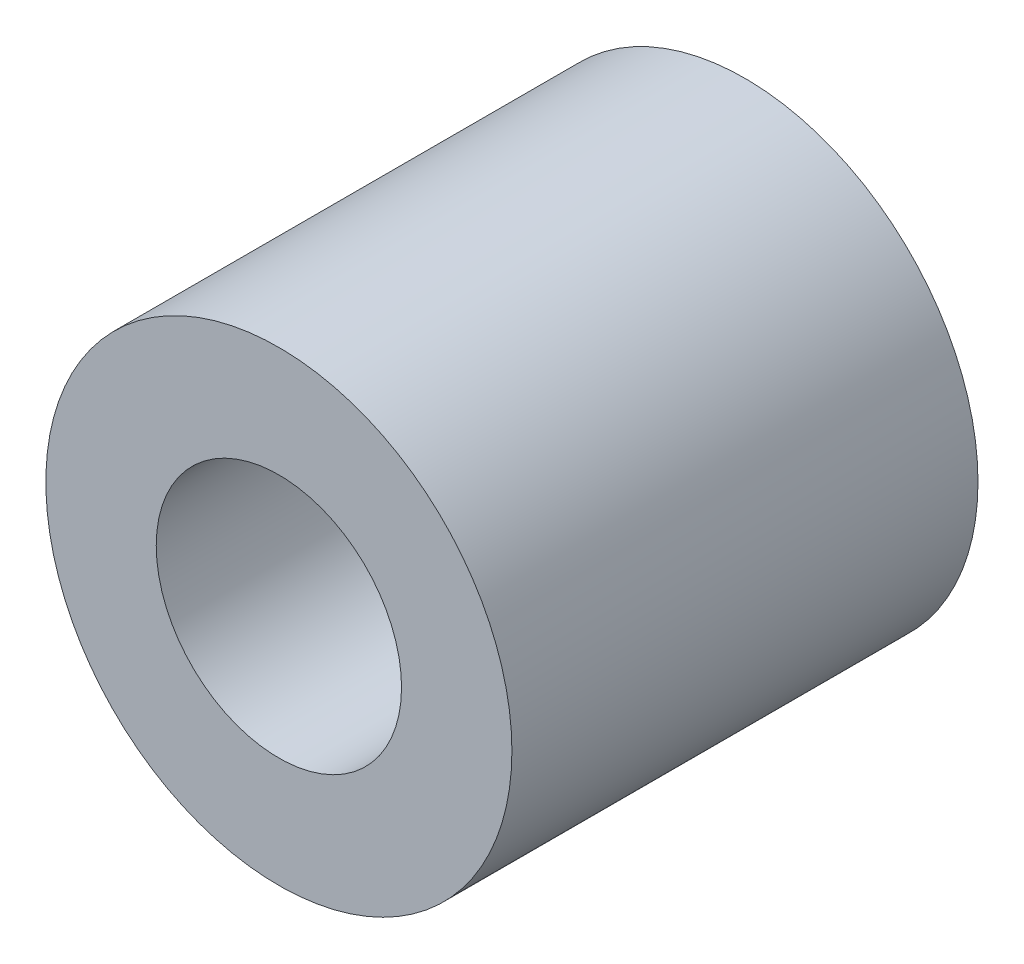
ISO-10303-21;
HEADER;
FILE_DESCRIPTION(('STEP AP214'),'2;1');
FILE_NAME('part.step','',(''),(''),'','','');
FILE_SCHEMA(('AUTOMOTIVE_DESIGN { 1 0 10303 214 1 1 1 1 }'));
ENDSEC;
DATA;
#1=APPLICATION_CONTEXT('core data for automotive mechanical design processes');
#2=APPLICATION_PROTOCOL_DEFINITION('international standard','automotive_design',2000,#1);
#3=PRODUCT_CONTEXT('',#1,'mechanical');
#4=PRODUCT('Part','Part','',(#3));
#5=PRODUCT_RELATED_PRODUCT_CATEGORY('part','',(#4));
#6=PRODUCT_DEFINITION_FORMATION('','',#4);
#7=PRODUCT_DEFINITION_CONTEXT('part definition',#1,'design');
#8=PRODUCT_DEFINITION('design','',#6,#7);
#9=PRODUCT_DEFINITION_SHAPE('','',#8);
#10=(LENGTH_UNIT() NAMED_UNIT(*) SI_UNIT(.MILLI.,.METRE.));
#11=(NAMED_UNIT(*) PLANE_ANGLE_UNIT() SI_UNIT($,.RADIAN.));
#12=(NAMED_UNIT(*) SI_UNIT($,.STERADIAN.) SOLID_ANGLE_UNIT());
#13=UNCERTAINTY_MEASURE_WITH_UNIT(LENGTH_MEASURE(1.E-05),#10,'distance_accuracy_value','');
#14=(GEOMETRIC_REPRESENTATION_CONTEXT(3) GLOBAL_UNCERTAINTY_ASSIGNED_CONTEXT((#13)) GLOBAL_UNIT_ASSIGNED_CONTEXT((#10,
#11,#12)) REPRESENTATION_CONTEXT('',''));
#15=CARTESIAN_POINT('',(0.,0.,0.));
#16=DIRECTION('',(0.,0.,1.));
#17=DIRECTION('',(1.,0.,0.));
#18=AXIS2_PLACEMENT_3D('',#15,#16,#17);
#19=CARTESIAN_POINT('',(0.,0.,-9.5));
#20=DIRECTION('',(0.,0.,1.));
#21=DIRECTION('',(1.,0.,0.));
#22=AXIS2_PLACEMENT_3D('',#19,#20,#21);
#23=CYLINDRICAL_SURFACE('',#22,4.75);
#24=CARTESIAN_POINT('',(0.,0.,-9.5));
#25=DIRECTION('',(0.,0.,1.));
#26=DIRECTION('',(1.,0.,0.));
#27=AXIS2_PLACEMENT_3D('',#24,#25,#26);
#28=CIRCLE('',#27,4.75);
#29=CARTESIAN_POINT('',(4.75,0.,-9.5));
#30=VERTEX_POINT('',#29);
#31=EDGE_CURVE('E10',#30,#30,#28,.T.);
#32=ORIENTED_EDGE('',*,*,#31,.T.);
#33=EDGE_LOOP('',(#32));
#34=FACE_BOUND('',#33,.T.);
#35=CARTESIAN_POINT('',(0.,0.,0.));
#36=DIRECTION('',(0.,0.,1.));
#37=DIRECTION('',(1.,0.,0.));
#38=AXIS2_PLACEMENT_3D('',#35,#36,#37);
#39=CIRCLE('',#38,4.75);
#40=CARTESIAN_POINT('',(4.75,0.,0.));
#41=VERTEX_POINT('',#40);
#42=EDGE_CURVE('E32',#41,#41,#39,.T.);
#43=ORIENTED_EDGE('',*,*,#42,.F.);
#44=EDGE_LOOP('',(#43));
#45=FACE_BOUND('',#44,.T.);
#46=ADVANCED_FACE('F29',(#34,#45),#23,.T.);
#47=CARTESIAN_POINT('',(0.,0.,-9.5));
#48=DIRECTION('',(0.,0.,1.));
#49=DIRECTION('',(1.,0.,0.));
#50=AXIS2_PLACEMENT_3D('',#47,#48,#49);
#51=PLANE('',#50);
#52=CARTESIAN_POINT('',(0.,0.,-9.5));
#53=DIRECTION('',(0.,0.,1.));
#54=DIRECTION('',(1.,0.,0.));
#55=AXIS2_PLACEMENT_3D('',#52,#53,#54);
#56=CIRCLE('',#55,2.5);
#57=CARTESIAN_POINT('',(2.5,0.,-9.5));
#58=VERTEX_POINT('',#57);
#59=EDGE_CURVE('E39',#58,#58,#56,.T.);
#60=ORIENTED_EDGE('',*,*,#59,.T.);
#61=EDGE_LOOP('',(#60));
#62=FACE_BOUND('',#61,.T.);
#63=ORIENTED_EDGE('',*,*,#31,.F.);
#64=EDGE_LOOP('',(#63));
#65=FACE_BOUND('',#64,.T.);
#66=ADVANCED_FACE('F47',(#62,#65),#51,.F.);
#67=CARTESIAN_POINT('',(0.,0.,0.));
#68=DIRECTION('',(0.,0.,1.));
#69=DIRECTION('',(1.,0.,0.));
#70=AXIS2_PLACEMENT_3D('',#67,#68,#69);
#71=PLANE('',#70);
#72=CARTESIAN_POINT('',(0.,0.,0.));
#73=DIRECTION('',(0.,0.,1.));
#74=DIRECTION('',(1.,0.,0.));
#75=AXIS2_PLACEMENT_3D('',#72,#73,#74);
#76=CIRCLE('',#75,2.5);
#77=CARTESIAN_POINT('',(2.5,0.,0.));
#78=VERTEX_POINT('',#77);
#79=EDGE_CURVE('E41',#78,#78,#76,.T.);
#80=ORIENTED_EDGE('',*,*,#79,.F.);
#81=EDGE_LOOP('',(#80));
#82=FACE_BOUND('',#81,.T.);
#83=ORIENTED_EDGE('',*,*,#42,.T.);
#84=EDGE_LOOP('',(#83));
#85=FACE_BOUND('',#84,.T.);
#86=ADVANCED_FACE('F53',(#82,#85),#71,.T.);
#87=CARTESIAN_POINT('',(0.,0.,-9.5));
#88=DIRECTION('',(0.,0.,1.));
#89=DIRECTION('',(1.,0.,0.));
#90=AXIS2_PLACEMENT_3D('',#87,#88,#89);
#91=CYLINDRICAL_SURFACE('',#90,2.5);
#92=ORIENTED_EDGE('',*,*,#59,.F.);
#93=EDGE_LOOP('',(#92));
#94=FACE_BOUND('',#93,.T.);
#95=ORIENTED_EDGE('',*,*,#79,.T.);
#96=EDGE_LOOP('',(#95));
#97=FACE_BOUND('',#96,.T.);
#98=ADVANCED_FACE('F50',(#94,#97),#91,.F.);
#99=CLOSED_SHELL('',(#46,#66,#86,#98));
#100=MANIFOLD_SOLID_BREP('B2',#99);
#101=ADVANCED_BREP_SHAPE_REPRESENTATION('',(#18,#100),#14);
#102=SHAPE_DEFINITION_REPRESENTATION(#9,#101);
ENDSEC;
END-ISO-10303-21;
